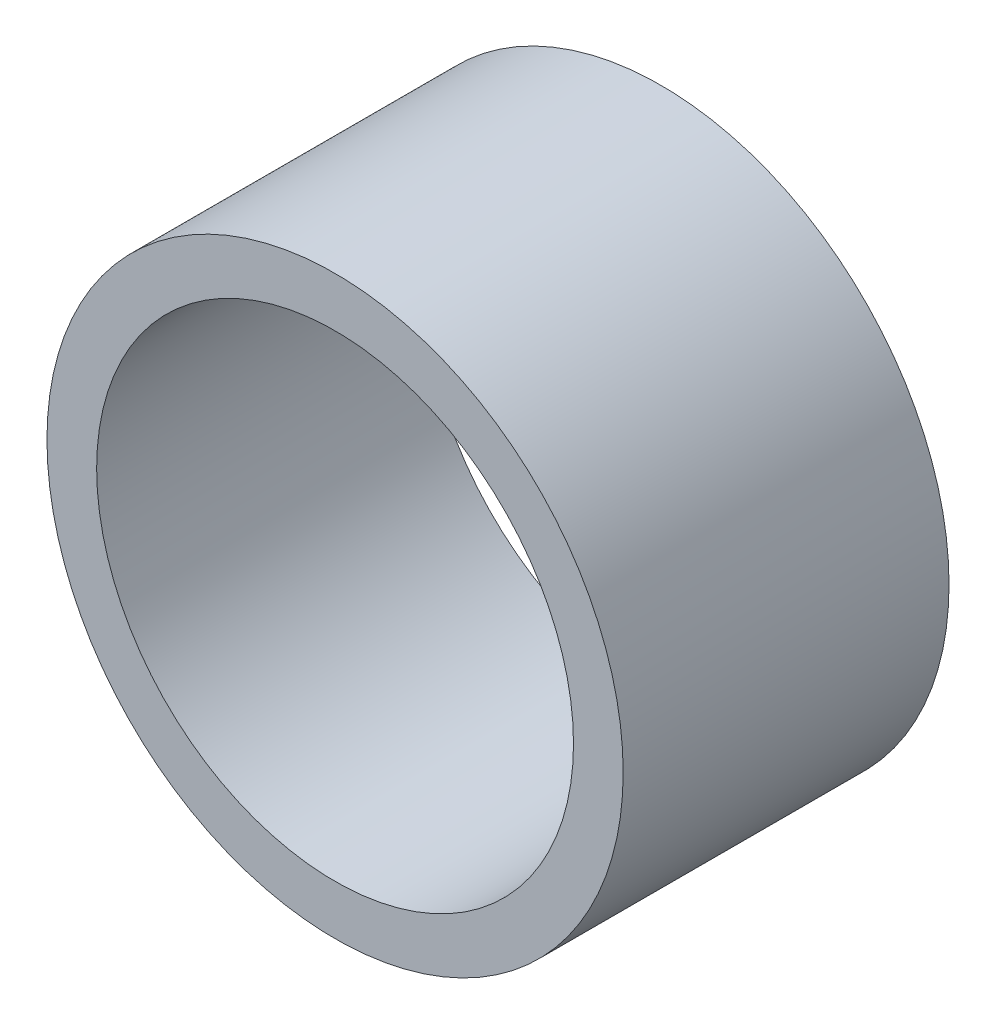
from build123d import *

# Parameters (mm, degrees)
ESQUISSE1_R          = 14.5
ESQUISSE1_R_2        = 12
BASE_EXTRUSION_DEPTH = 16.4


with BuildPart() as part:
    # Esquisse1 → Base-Extrusion (new body)
    with BuildSketch(Plane.XY):
        with Locations(Location((0, 0, 0), (0, 0, 180))):
            Circle(ESQUISSE1_R)
        with Locations(Location((0, 0, 0), (0, 0, 180))):
            Circle(ESQUISSE1_R_2, mode=Mode.SUBTRACT)
    extrude(amount=BASE_EXTRUSION_DEPTH)


solid = part.part
